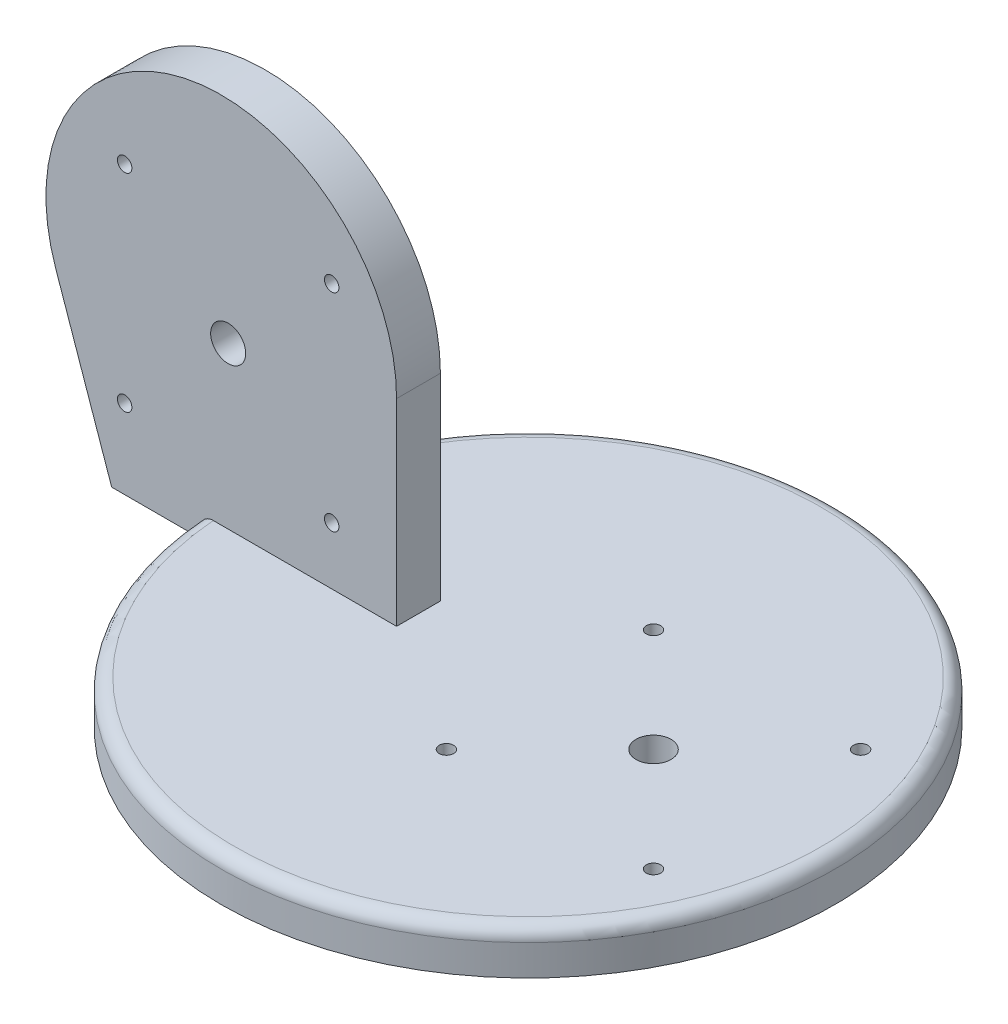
ISO-10303-21;
HEADER;
FILE_DESCRIPTION(('STEP AP214'),'2;1');
FILE_NAME('part.step','',(''),(''),'','','');
FILE_SCHEMA(('AUTOMOTIVE_DESIGN { 1 0 10303 214 1 1 1 1 }'));
ENDSEC;
DATA;
#1=APPLICATION_CONTEXT('core data for automotive mechanical design processes');
#2=APPLICATION_PROTOCOL_DEFINITION('international standard','automotive_design',2000,#1);
#3=PRODUCT_CONTEXT('',#1,'mechanical');
#4=PRODUCT('Part','Part','',(#3));
#5=PRODUCT_RELATED_PRODUCT_CATEGORY('part','',(#4));
#6=PRODUCT_DEFINITION_FORMATION('','',#4);
#7=PRODUCT_DEFINITION_CONTEXT('part definition',#1,'design');
#8=PRODUCT_DEFINITION('design','',#6,#7);
#9=PRODUCT_DEFINITION_SHAPE('','',#8);
#10=(LENGTH_UNIT() NAMED_UNIT(*) SI_UNIT(.MILLI.,.METRE.));
#11=(NAMED_UNIT(*) PLANE_ANGLE_UNIT() SI_UNIT($,.RADIAN.));
#12=(NAMED_UNIT(*) SI_UNIT($,.STERADIAN.) SOLID_ANGLE_UNIT());
#13=UNCERTAINTY_MEASURE_WITH_UNIT(LENGTH_MEASURE(1.E-05),#10,'distance_accuracy_value','');
#14=(GEOMETRIC_REPRESENTATION_CONTEXT(3) GLOBAL_UNCERTAINTY_ASSIGNED_CONTEXT((#13)) GLOBAL_UNIT_ASSIGNED_CONTEXT((#10,
#11,#12)) REPRESENTATION_CONTEXT('',''));
#15=CARTESIAN_POINT('',(0.,0.,0.));
#16=DIRECTION('',(0.,0.,1.));
#17=DIRECTION('',(1.,0.,0.));
#18=AXIS2_PLACEMENT_3D('',#15,#16,#17);
#19=CARTESIAN_POINT('',(0.,10.,0.));
#20=DIRECTION('',(0.,-1.,0.));
#21=DIRECTION('',(0.,0.,-1.));
#22=AXIS2_PLACEMENT_3D('',#19,#20,#21);
#23=CYLINDRICAL_SURFACE('',#22,70.);
#24=CARTESIAN_POINT('',(0.,0.,0.));
#25=DIRECTION('',(0.,1.,0.));
#26=DIRECTION('',(0.,0.,1.));
#27=AXIS2_PLACEMENT_3D('',#24,#25,#26);
#28=CIRCLE('',#27,70.);
#29=CARTESIAN_POINT('',(0.,0.,70.));
#30=VERTEX_POINT('',#29);
#31=EDGE_CURVE('E222',#30,#30,#28,.T.);
#32=ORIENTED_EDGE('',*,*,#31,.T.);
#33=EDGE_LOOP('',(#32));
#34=FACE_BOUND('',#33,.T.);
#35=DIRECTION('',(0.,-1.,0.));
#36=VECTOR('',#35,1.);
#37=CARTESIAN_POINT('',(-69.8212002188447,10.,-5.));
#38=LINE('',#37,#36);
#39=CARTESIAN_POINT('',(-69.8212002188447,4.99999999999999,-5.));
#40=VERTEX_POINT('',#39);
#41=CARTESIAN_POINT('',(-69.8212002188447,7.,-5.));
#42=VERTEX_POINT('',#41);
#43=EDGE_CURVE('E215',#40,#42,#38,.F.);
#44=ORIENTED_EDGE('',*,*,#43,.T.);
#45=CARTESIAN_POINT('',(0.,7.,0.));
#46=DIRECTION('',(0.,1.,0.));
#47=DIRECTION('',(0.,0.,1.));
#48=AXIS2_PLACEMENT_3D('',#45,#46,#47);
#49=CIRCLE('',#48,70.);
#50=CARTESIAN_POINT('',(-69.8212002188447,7.,5.));
#51=VERTEX_POINT('',#50);
#52=EDGE_CURVE('E62',#42,#51,#49,.F.);
#53=ORIENTED_EDGE('',*,*,#52,.T.);
#54=DIRECTION('',(0.,-1.,0.));
#55=VECTOR('',#54,1.);
#56=CARTESIAN_POINT('',(-69.8212002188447,10.,5.));
#57=LINE('',#56,#55);
#58=CARTESIAN_POINT('',(-69.8212002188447,4.99999999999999,5.));
#59=VERTEX_POINT('',#58);
#60=EDGE_CURVE('E217',#59,#51,#57,.F.);
#61=ORIENTED_EDGE('',*,*,#60,.F.);
#62=CARTESIAN_POINT('',(0.,5.,0.));
#63=DIRECTION('',(0.,1.,0.));
#64=DIRECTION('',(-1.,0.,0.));
#65=AXIS2_PLACEMENT_3D('',#62,#63,#64);
#66=CIRCLE('',#65,70.);
#67=EDGE_CURVE('E235',#40,#59,#66,.T.);
#68=ORIENTED_EDGE('',*,*,#67,.F.);
#69=EDGE_LOOP('',(#44,#53,#61,#68));
#70=FACE_BOUND('',#69,.T.);
#71=ADVANCED_FACE('F36',(#34,#70),#23,.T.);
#72=CARTESIAN_POINT('',(0.,10.,0.));
#73=DIRECTION('',(0.,1.,0.));
#74=DIRECTION('',(0.,0.,1.));
#75=AXIS2_PLACEMENT_3D('',#72,#73,#74);
#76=PLANE('',#75);
#77=CARTESIAN_POINT('',(28.624,10.,0.00199999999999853));
#78=DIRECTION('',(0.,1.,0.));
#79=DIRECTION('',(0.,0.,1.));
#80=AXIS2_PLACEMENT_3D('',#77,#78,#79);
#81=CIRCLE('',#80,3.99999999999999);
#82=CARTESIAN_POINT('',(28.624,10.,4.00199999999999));
#83=VERTEX_POINT('',#82);
#84=EDGE_CURVE('E609',#83,#83,#81,.T.);
#85=ORIENTED_EDGE('',*,*,#84,.F.);
#86=EDGE_LOOP('',(#85));
#87=FACE_BOUND('',#86,.T.);
#88=CARTESIAN_POINT('',(5.,10.,-23.622));
#89=DIRECTION('',(0.,1.,0.));
#90=DIRECTION('',(0.,0.,1.));
#91=AXIS2_PLACEMENT_3D('',#88,#89,#90);
#92=CIRCLE('',#91,1.64999999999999);
#93=CARTESIAN_POINT('',(5.,10.,-21.972));
#94=VERTEX_POINT('',#93);
#95=EDGE_CURVE('E162',#94,#94,#92,.T.);
#96=ORIENTED_EDGE('',*,*,#95,.F.);
#97=EDGE_LOOP('',(#96));
#98=FACE_BOUND('',#97,.T.);
#99=CARTESIAN_POINT('',(52.244,10.,-23.622));
#100=DIRECTION('',(0.,1.,0.));
#101=DIRECTION('',(0.,0.,1.));
#102=AXIS2_PLACEMENT_3D('',#99,#100,#101);
#103=CIRCLE('',#102,1.64999999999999);
#104=CARTESIAN_POINT('',(52.244,10.,-21.972));
#105=VERTEX_POINT('',#104);
#106=EDGE_CURVE('E168',#105,#105,#103,.T.);
#107=ORIENTED_EDGE('',*,*,#106,.F.);
#108=EDGE_LOOP('',(#107));
#109=FACE_BOUND('',#108,.T.);
#110=CARTESIAN_POINT('',(52.244,10.,23.622));
#111=DIRECTION('',(0.,1.,0.));
#112=DIRECTION('',(0.,0.,1.));
#113=AXIS2_PLACEMENT_3D('',#110,#111,#112);
#114=CIRCLE('',#113,1.64999999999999);
#115=CARTESIAN_POINT('',(52.244,10.,25.272));
#116=VERTEX_POINT('',#115);
#117=EDGE_CURVE('E174',#116,#116,#114,.T.);
#118=ORIENTED_EDGE('',*,*,#117,.F.);
#119=EDGE_LOOP('',(#118));
#120=FACE_BOUND('',#119,.T.);
#121=CARTESIAN_POINT('',(5.,10.,23.622));
#122=DIRECTION('',(0.,1.,0.));
#123=DIRECTION('',(0.,0.,1.));
#124=AXIS2_PLACEMENT_3D('',#121,#122,#123);
#125=CIRCLE('',#124,1.64999999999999);
#126=CARTESIAN_POINT('',(5.,10.,25.272));
#127=VERTEX_POINT('',#126);
#128=EDGE_CURVE('E180',#127,#127,#125,.T.);
#129=ORIENTED_EDGE('',*,*,#128,.F.);
#130=EDGE_LOOP('',(#129));
#131=FACE_BOUND('',#130,.T.);
#132=DIRECTION('',(-1.,0.,0.));
#133=VECTOR('',#132,1.);
#134=CARTESIAN_POINT('',(0.,10.,5.));
#135=LINE('',#134,#133);
#136=CARTESIAN_POINT('',(-25.,10.,5.));
#137=VERTEX_POINT('',#136);
#138=CARTESIAN_POINT('',(-66.8131723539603,10.,5.));
#139=VERTEX_POINT('',#138);
#140=EDGE_CURVE('E232',#137,#139,#135,.T.);
#141=ORIENTED_EDGE('',*,*,#140,.T.);
#142=CARTESIAN_POINT('',(0.,10.,0.));
#143=DIRECTION('',(0.,1.,0.));
#144=DIRECTION('',(0.,0.,1.));
#145=AXIS2_PLACEMENT_3D('',#142,#143,#144);
#146=CIRCLE('',#145,67.);
#147=CARTESIAN_POINT('',(-66.8131723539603,10.,-5.));
#148=VERTEX_POINT('',#147);
#149=EDGE_CURVE('E238',#139,#148,#146,.T.);
#150=ORIENTED_EDGE('',*,*,#149,.T.);
#151=DIRECTION('',(-1.,0.,0.));
#152=VECTOR('',#151,1.);
#153=CARTESIAN_POINT('',(0.,10.,-5.));
#154=LINE('',#153,#152);
#155=CARTESIAN_POINT('',(-25.,10.,-5.));
#156=VERTEX_POINT('',#155);
#157=EDGE_CURVE('E226',#156,#148,#154,.T.);
#158=ORIENTED_EDGE('',*,*,#157,.F.);
#159=DIRECTION('',(0.,0.,1.));
#160=VECTOR('',#159,1.);
#161=CARTESIAN_POINT('',(-25.,10.,0.));
#162=LINE('',#161,#160);
#163=EDGE_CURVE('E230',#156,#137,#162,.T.);
#164=ORIENTED_EDGE('',*,*,#163,.T.);
#165=EDGE_LOOP('',(#141,#150,#158,#164));
#166=FACE_BOUND('',#165,.T.);
#167=ADVANCED_FACE('F279',(#87,#98,#109,#120,#131,#166),#76,.T.);
#168=CARTESIAN_POINT('',(0.,0.,0.));
#169=DIRECTION('',(0.,1.,0.));
#170=DIRECTION('',(0.,0.,1.));
#171=AXIS2_PLACEMENT_3D('',#168,#169,#170);
#172=PLANE('',#171);
#173=CARTESIAN_POINT('',(0.,0.,0.));
#174=DIRECTION('',(0.,-1.,0.));
#175=DIRECTION('',(0.,0.,-1.));
#176=AXIS2_PLACEMENT_3D('',#173,#174,#175);
#177=CIRCLE('',#176,65.);
#178=CARTESIAN_POINT('',(0.,0.,-65.));
#179=VERTEX_POINT('',#178);
#180=EDGE_CURVE('E223',#179,#179,#177,.T.);
#181=ORIENTED_EDGE('',*,*,#180,.F.);
#182=EDGE_LOOP('',(#181));
#183=FACE_BOUND('',#182,.T.);
#184=ORIENTED_EDGE('',*,*,#31,.F.);
#185=EDGE_LOOP('',(#184));
#186=FACE_BOUND('',#185,.T.);
#187=ADVANCED_FACE('F277',(#183,#186),#172,.F.);
#188=CARTESIAN_POINT('',(0.,-3.,0.));
#189=DIRECTION('',(0.,1.,0.));
#190=DIRECTION('',(0.,0.,1.));
#191=AXIS2_PLACEMENT_3D('',#188,#189,#190);
#192=CYLINDRICAL_SURFACE('',#191,65.);
#193=CARTESIAN_POINT('',(0.,-3.,0.));
#194=DIRECTION('',(0.,-1.,0.));
#195=DIRECTION('',(0.,0.,-1.));
#196=AXIS2_PLACEMENT_3D('',#193,#194,#195);
#197=CIRCLE('',#196,65.);
#198=CARTESIAN_POINT('',(0.,-3.,-65.));
#199=VERTEX_POINT('',#198);
#200=EDGE_CURVE('E219',#199,#199,#197,.T.);
#201=ORIENTED_EDGE('',*,*,#200,.F.);
#202=EDGE_LOOP('',(#201));
#203=FACE_BOUND('',#202,.T.);
#204=ORIENTED_EDGE('',*,*,#180,.T.);
#205=EDGE_LOOP('',(#204));
#206=FACE_BOUND('',#205,.T.);
#207=ADVANCED_FACE('F273',(#203,#206),#192,.T.);
#208=CARTESIAN_POINT('',(0.,-3.,0.));
#209=DIRECTION('',(0.,-1.,0.));
#210=DIRECTION('',(0.,0.,-1.));
#211=AXIS2_PLACEMENT_3D('',#208,#209,#210);
#212=PLANE('',#211);
#213=CARTESIAN_POINT('',(28.624,-3.,0.00199999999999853));
#214=DIRECTION('',(0.,1.,0.));
#215=DIRECTION('',(0.,0.,1.));
#216=AXIS2_PLACEMENT_3D('',#213,#214,#215);
#217=CIRCLE('',#216,4.);
#218=CARTESIAN_POINT('',(28.624,-3.,4.002));
#219=VERTEX_POINT('',#218);
#220=EDGE_CURVE('E138',#219,#219,#217,.T.);
#221=ORIENTED_EDGE('',*,*,#220,.T.);
#222=EDGE_LOOP('',(#221));
#223=FACE_BOUND('',#222,.T.);
#224=ORIENTED_EDGE('',*,*,#200,.T.);
#225=EDGE_LOOP('',(#224));
#226=FACE_BOUND('',#225,.T.);
#227=ADVANCED_FACE('F270',(#223,#226),#212,.T.);
#228=CARTESIAN_POINT('',(-65.,55.,5.));
#229=DIRECTION('',(0.,0.,-1.));
#230=DIRECTION('',(-1.,0.,0.));
#231=AXIS2_PLACEMENT_3D('',#228,#229,#230);
#232=PLANE('',#231);
#233=CARTESIAN_POINT('',(-87.0402855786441,70.3170248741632,5.));
#234=DIRECTION('',(0.,0.,1.));
#235=DIRECTION('',(1.,0.,0.));
#236=AXIS2_PLACEMENT_3D('',#233,#234,#235);
#237=CIRCLE('',#236,1.64999999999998);
#238=CARTESIAN_POINT('',(-85.3902855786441,70.3170248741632,5.));
#239=VERTEX_POINT('',#238);
#240=EDGE_CURVE('E132',#239,#239,#237,.T.);
#241=ORIENTED_EDGE('',*,*,#240,.F.);
#242=EDGE_LOOP('',(#241));
#243=FACE_BOUND('',#242,.T.);
#244=CARTESIAN_POINT('',(-39.8002855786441,70.3170248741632,5.));
#245=DIRECTION('',(0.,0.,1.));
#246=DIRECTION('',(1.,0.,0.));
#247=AXIS2_PLACEMENT_3D('',#244,#245,#246);
#248=CIRCLE('',#247,1.64999999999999);
#249=CARTESIAN_POINT('',(-38.1502855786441,70.3170248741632,5.));
#250=VERTEX_POINT('',#249);
#251=EDGE_CURVE('E131',#250,#250,#248,.T.);
#252=ORIENTED_EDGE('',*,*,#251,.F.);
#253=EDGE_LOOP('',(#252));
#254=FACE_BOUND('',#253,.T.);
#255=CARTESIAN_POINT('',(-39.8002855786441,23.0770248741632,5.));
#256=DIRECTION('',(0.,0.,1.));
#257=DIRECTION('',(1.,0.,0.));
#258=AXIS2_PLACEMENT_3D('',#255,#256,#257);
#259=CIRCLE('',#258,1.64999999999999);
#260=CARTESIAN_POINT('',(-38.1502855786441,23.0770248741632,5.));
#261=VERTEX_POINT('',#260);
#262=EDGE_CURVE('E144',#261,#261,#259,.T.);
#263=ORIENTED_EDGE('',*,*,#262,.F.);
#264=EDGE_LOOP('',(#263));
#265=FACE_BOUND('',#264,.T.);
#266=CARTESIAN_POINT('',(-87.0402855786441,23.0770248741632,5.));
#267=DIRECTION('',(0.,0.,1.));
#268=DIRECTION('',(1.,0.,0.));
#269=AXIS2_PLACEMENT_3D('',#266,#267,#268);
#270=CIRCLE('',#269,1.64999999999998);
#271=CARTESIAN_POINT('',(-85.3902855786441,23.0770248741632,5.));
#272=VERTEX_POINT('',#271);
#273=EDGE_CURVE('E150',#272,#272,#270,.T.);
#274=ORIENTED_EDGE('',*,*,#273,.F.);
#275=EDGE_LOOP('',(#274));
#276=FACE_BOUND('',#275,.T.);
#277=CARTESIAN_POINT('',(-63.4202855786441,46.6970248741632,5.));
#278=DIRECTION('',(0.,0.,-1.));
#279=DIRECTION('',(-1.,0.,0.));
#280=AXIS2_PLACEMENT_3D('',#277,#278,#279);
#281=CIRCLE('',#280,3.99999999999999);
#282=CARTESIAN_POINT('',(-67.4202855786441,46.6970248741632,5.));
#283=VERTEX_POINT('',#282);
#284=EDGE_CURVE('E159',#283,#283,#281,.T.);
#285=ORIENTED_EDGE('',*,*,#284,.T.);
#286=EDGE_LOOP('',(#285));
#287=FACE_BOUND('',#286,.T.);
#288=DIRECTION('',(1.,0.,0.));
#289=VECTOR('',#288,1.);
#290=CARTESIAN_POINT('',(-25.,4.99999999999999,5.));
#291=LINE('',#290,#289);
#292=CARTESIAN_POINT('',(-90.,4.99999999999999,5.));
#293=VERTEX_POINT('',#292);
#294=EDGE_CURVE('E193',#293,#59,#291,.T.);
#295=ORIENTED_EDGE('',*,*,#294,.T.);
#296=ORIENTED_EDGE('',*,*,#60,.T.);
#297=CARTESIAN_POINT('',(-69.8212002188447,7.,5.));
#298=CARTESIAN_POINT('',(-69.8212084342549,7.08422120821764,5.));
#299=CARTESIAN_POINT('',(-69.8176445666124,7.1684385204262,5.));
#300=CARTESIAN_POINT('',(-69.8034362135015,7.33626942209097,5.));
#301=CARTESIAN_POINT('',(-69.7927921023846,7.41988304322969,5.));
#302=CARTESIAN_POINT('',(-69.7644984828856,7.58585112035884,5.));
#303=CARTESIAN_POINT('',(-69.7468547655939,7.6682065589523,5.));
#304=CARTESIAN_POINT('',(-69.7047069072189,7.8311180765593,5.));
#305=CARTESIAN_POINT('',(-69.6802028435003,7.91167417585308,5.));
#306=CARTESIAN_POINT('',(-69.5966030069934,8.149862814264,5.));
#307=CARTESIAN_POINT('',(-69.5274072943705,8.30408740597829,5.));
#308=CARTESIAN_POINT('',(-69.3641784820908,8.59863673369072,5.));
#309=CARTESIAN_POINT('',(-69.2701492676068,8.73896363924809,5.));
#310=CARTESIAN_POINT('',(-69.0597945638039,9.00205220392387,5.));
#311=CARTESIAN_POINT('',(-68.943444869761,9.12479453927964,5.));
#312=CARTESIAN_POINT('',(-68.6918108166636,9.34907894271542,5.));
#313=CARTESIAN_POINT('',(-68.556522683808,9.45061677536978,5.));
#314=CARTESIAN_POINT('',(-68.270509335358,9.62986808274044,5.));
#315=CARTESIAN_POINT('',(-68.1197445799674,9.70751840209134,5.));
#316=CARTESIAN_POINT('',(-67.8073684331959,9.83643772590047,5.));
#317=CARTESIAN_POINT('',(-67.645763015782,9.88772112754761,5.));
#318=CARTESIAN_POINT('',(-67.371540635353,9.95000516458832,5.));
#319=CARTESIAN_POINT('',(-67.2606182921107,9.96874219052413,5.));
#320=CARTESIAN_POINT('',(-67.037536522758,9.99373818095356,5.));
#321=CARTESIAN_POINT('',(-66.9253790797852,10.0000148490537,5.));
#322=CARTESIAN_POINT('',(-66.8131723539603,10.,5.));
#323=B_SPLINE_CURVE_WITH_KNOTS('',3,(#297,#298,#299,#300,#301,#302,#303,#304,#305,#306,#307,
#308,#309,#310,#311,#312,#313,#314,#315,#316,#317,#318,#319,#320,#321,#322),.UNSPECIFIED.,.F.,
.F.,(4,2,2,2,2,2,2,2,2,2,2,2,4),(0.,0.252581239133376,0.505149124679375,0.757508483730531,
1.00986499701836,1.51436249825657,2.01878111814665,2.52374986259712,3.02881937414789,
3.53521296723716,4.0413297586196,4.3781574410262,4.71450621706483),.UNSPECIFIED.);
#324=EDGE_CURVE('E11',#51,#139,#323,.T.);
#325=ORIENTED_EDGE('',*,*,#324,.T.);
#326=ORIENTED_EDGE('',*,*,#140,.F.);
#327=DIRECTION('',(0.,1.,0.));
#328=VECTOR('',#327,1.);
#329=CARTESIAN_POINT('',(-25.,55.,5.));
#330=LINE('',#329,#328);
#331=CARTESIAN_POINT('',(-25.,55.,5.));
#332=VERTEX_POINT('',#331);
#333=EDGE_CURVE('E196',#137,#332,#330,.T.);
#334=ORIENTED_EDGE('',*,*,#333,.T.);
#335=CARTESIAN_POINT('',(-65.,55.,5.));
#336=DIRECTION('',(0.,0.,1.));
#337=DIRECTION('',(-1.,0.,0.));
#338=AXIS2_PLACEMENT_3D('',#335,#336,#337);
#339=CIRCLE('',#338,40.);
#340=CARTESIAN_POINT('',(-102.792798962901,41.8963994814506,5.));
#341=VERTEX_POINT('',#340);
#342=EDGE_CURVE('E187',#332,#341,#339,.T.);
#343=ORIENTED_EDGE('',*,*,#342,.T.);
#344=DIRECTION('',(0.327590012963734,-0.944819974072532,0.));
#345=VECTOR('',#344,1.);
#346=CARTESIAN_POINT('',(-90.,4.99999999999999,5.));
#347=LINE('',#346,#345);
#348=EDGE_CURVE('E190',#341,#293,#347,.T.);
#349=ORIENTED_EDGE('',*,*,#348,.T.);
#350=EDGE_LOOP('',(#295,#296,#325,#326,#334,#343,#349));
#351=FACE_BOUND('',#350,.T.);
#352=ADVANCED_FACE('F250',(#243,#254,#265,#276,#287,#351),#232,.F.);
#353=CARTESIAN_POINT('',(-65.,55.,-5.));
#354=DIRECTION('',(0.,0.,-1.));
#355=DIRECTION('',(-1.,0.,0.));
#356=AXIS2_PLACEMENT_3D('',#353,#354,#355);
#357=PLANE('',#356);
#358=CARTESIAN_POINT('',(-63.4202855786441,46.6970248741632,-5.));
#359=DIRECTION('',(0.,0.,-1.));
#360=DIRECTION('',(-1.,0.,0.));
#361=AXIS2_PLACEMENT_3D('',#358,#359,#360);
#362=CIRCLE('',#361,3.99999999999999);
#363=CARTESIAN_POINT('',(-67.4202855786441,46.6970248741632,-5.));
#364=VERTEX_POINT('',#363);
#365=EDGE_CURVE('E156',#364,#364,#362,.T.);
#366=ORIENTED_EDGE('',*,*,#365,.F.);
#367=EDGE_LOOP('',(#366));
#368=FACE_BOUND('',#367,.T.);
#369=ORIENTED_EDGE('',*,*,#43,.F.);
#370=DIRECTION('',(1.,0.,0.));
#371=VECTOR('',#370,1.);
#372=CARTESIAN_POINT('',(-25.,4.99999999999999,-5.));
#373=LINE('',#372,#371);
#374=CARTESIAN_POINT('',(-90.,4.99999999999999,-5.));
#375=VERTEX_POINT('',#374);
#376=EDGE_CURVE('E203',#375,#40,#373,.T.);
#377=ORIENTED_EDGE('',*,*,#376,.F.);
#378=DIRECTION('',(0.327590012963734,-0.944819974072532,0.));
#379=VECTOR('',#378,1.);
#380=CARTESIAN_POINT('',(-90.,4.99999999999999,-5.));
#381=LINE('',#380,#379);
#382=CARTESIAN_POINT('',(-102.792798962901,41.8963994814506,-5.));
#383=VERTEX_POINT('',#382);
#384=EDGE_CURVE('E201',#383,#375,#381,.T.);
#385=ORIENTED_EDGE('',*,*,#384,.F.);
#386=CARTESIAN_POINT('',(-65.,55.,-5.));
#387=DIRECTION('',(0.,0.,1.));
#388=DIRECTION('',(-1.,0.,0.));
#389=AXIS2_PLACEMENT_3D('',#386,#387,#388);
#390=CIRCLE('',#389,40.);
#391=CARTESIAN_POINT('',(-25.,55.,-5.));
#392=VERTEX_POINT('',#391);
#393=EDGE_CURVE('E186',#392,#383,#390,.T.);
#394=ORIENTED_EDGE('',*,*,#393,.F.);
#395=DIRECTION('',(0.,1.,0.));
#396=VECTOR('',#395,1.);
#397=CARTESIAN_POINT('',(-25.,55.,-5.));
#398=LINE('',#397,#396);
#399=EDGE_CURVE('E191',#156,#392,#398,.T.);
#400=ORIENTED_EDGE('',*,*,#399,.F.);
#401=ORIENTED_EDGE('',*,*,#157,.T.);
#402=CARTESIAN_POINT('',(-66.8131723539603,10.,-5.));
#403=CARTESIAN_POINT('',(-66.8979472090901,10.0000079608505,-5.));
#404=CARTESIAN_POINT('',(-66.9827183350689,9.99642664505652,-5.));
#405=CARTESIAN_POINT('',(-67.1516555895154,9.98214661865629,-5.));
#406=CARTESIAN_POINT('',(-67.235821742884,9.97144820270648,-5.));
#407=CARTESIAN_POINT('',(-67.4029023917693,9.94300469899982,-5.));
#408=CARTESIAN_POINT('',(-67.4858176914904,9.92526435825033,-5.));
#409=CARTESIAN_POINT('',(-67.6498390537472,9.88287845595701,-5.));
#410=CARTESIAN_POINT('',(-67.7309451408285,9.85823298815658,-5.));
#411=CARTESIAN_POINT('',(-67.9707715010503,9.77413166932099,-5.));
#412=CARTESIAN_POINT('',(-68.1260623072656,9.70450022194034,-5.));
#413=CARTESIAN_POINT('',(-68.4226111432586,9.54016784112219,-5.));
#414=CARTESIAN_POINT('',(-68.5638719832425,9.44547194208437,-5.));
#415=CARTESIAN_POINT('',(-68.8282863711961,9.23378792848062,-5.));
#416=CARTESIAN_POINT('',(-68.9514639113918,9.11682983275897,-5.));
#417=CARTESIAN_POINT('',(-69.1763930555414,8.86382096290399,-5.));
#418=CARTESIAN_POINT('',(-69.2781405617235,8.72776654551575,-5.));
#419=CARTESIAN_POINT('',(-69.4570370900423,8.44080697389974,-5.));
#420=CARTESIAN_POINT('',(-69.5342432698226,8.28993741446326,-5.));
#421=CARTESIAN_POINT('',(-69.6621227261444,7.97738913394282,-5.));
#422=CARTESIAN_POINT('',(-69.712812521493,7.81571721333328,-5.));
#423=CARTESIAN_POINT('',(-69.7733449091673,7.54417781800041,-5.));
#424=CARTESIAN_POINT('',(-69.7912798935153,7.43604579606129,-5.));
#425=CARTESIAN_POINT('',(-69.8152057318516,7.21862459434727,-5.));
#426=CARTESIAN_POINT('',(-69.8212135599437,7.10933728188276,-5.));
#427=CARTESIAN_POINT('',(-69.8212002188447,7.,-5.));
#428=B_SPLINE_CURVE_WITH_KNOTS('',3,(#402,#403,#404,#405,#406,#407,#408,#409,#410,#411,#412,
#413,#414,#415,#416,#417,#418,#419,#420,#421,#422,#423,#424,#425,#426,#427),.UNSPECIFIED.,.F.,
.F.,(4,2,2,2,2,2,2,2,2,2,2,2,4),(0.,0.254242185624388,0.508473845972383,0.762534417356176,
1.01659153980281,1.52451815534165,2.03234282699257,2.5394875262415,3.04672911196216,
3.55278050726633,4.0585162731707,4.38673328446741,4.71448285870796),.UNSPECIFIED.);
#429=EDGE_CURVE('E49',#148,#42,#428,.T.);
#430=ORIENTED_EDGE('',*,*,#429,.T.);
#431=EDGE_LOOP('',(#369,#377,#385,#394,#400,#401,#430));
#432=FACE_BOUND('',#431,.T.);
#433=ADVANCED_FACE('F245',(#368,#432),#357,.T.);
#434=CARTESIAN_POINT('',(-65.,55.,5.));
#435=DIRECTION('',(0.,0.,-1.));
#436=DIRECTION('',(-1.,0.,0.));
#437=AXIS2_PLACEMENT_3D('',#434,#435,#436);
#438=CYLINDRICAL_SURFACE('',#437,40.);
#439=ORIENTED_EDGE('',*,*,#393,.T.);
#440=DIRECTION('',(0.,0.,-1.));
#441=VECTOR('',#440,1.);
#442=CARTESIAN_POINT('',(-102.792798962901,41.8963994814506,5.));
#443=LINE('',#442,#441);
#444=EDGE_CURVE('E212',#341,#383,#443,.T.);
#445=ORIENTED_EDGE('',*,*,#444,.F.);
#446=ORIENTED_EDGE('',*,*,#342,.F.);
#447=DIRECTION('',(0.,0.,-1.));
#448=VECTOR('',#447,1.);
#449=CARTESIAN_POINT('',(-25.,55.,5.));
#450=LINE('',#449,#448);
#451=EDGE_CURVE('E198',#332,#392,#450,.T.);
#452=ORIENTED_EDGE('',*,*,#451,.T.);
#453=EDGE_LOOP('',(#439,#445,#446,#452));
#454=FACE_BOUND('',#453,.T.);
#455=ADVANCED_FACE('F249',(#454),#438,.T.);
#456=CARTESIAN_POINT('',(-90.,4.99999999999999,5.));
#457=DIRECTION('',(0.944819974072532,0.327590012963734,0.));
#458=DIRECTION('',(-0.327590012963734,0.944819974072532,0.));
#459=AXIS2_PLACEMENT_3D('',#456,#457,#458);
#460=PLANE('',#459);
#461=ORIENTED_EDGE('',*,*,#384,.T.);
#462=DIRECTION('',(0.,0.,-1.));
#463=VECTOR('',#462,1.);
#464=CARTESIAN_POINT('',(-90.,4.99999999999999,5.));
#465=LINE('',#464,#463);
#466=EDGE_CURVE('E209',#293,#375,#465,.T.);
#467=ORIENTED_EDGE('',*,*,#466,.F.);
#468=ORIENTED_EDGE('',*,*,#348,.F.);
#469=ORIENTED_EDGE('',*,*,#444,.T.);
#470=EDGE_LOOP('',(#461,#467,#468,#469));
#471=FACE_BOUND('',#470,.T.);
#472=ADVANCED_FACE('F262',(#471),#460,.F.);
#473=CARTESIAN_POINT('',(-25.,4.99999999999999,5.));
#474=DIRECTION('',(0.,1.,0.));
#475=DIRECTION('',(-1.,0.,0.));
#476=AXIS2_PLACEMENT_3D('',#473,#474,#475);
#477=PLANE('',#476);
#478=ORIENTED_EDGE('',*,*,#376,.T.);
#479=ORIENTED_EDGE('',*,*,#67,.T.);
#480=ORIENTED_EDGE('',*,*,#294,.F.);
#481=ORIENTED_EDGE('',*,*,#466,.T.);
#482=EDGE_LOOP('',(#478,#479,#480,#481));
#483=FACE_BOUND('',#482,.T.);
#484=ADVANCED_FACE('F258',(#483),#477,.F.);
#485=CARTESIAN_POINT('',(-25.,55.,5.));
#486=DIRECTION('',(-1.,0.,0.));
#487=DIRECTION('',(0.,-1.,0.));
#488=AXIS2_PLACEMENT_3D('',#485,#486,#487);
#489=PLANE('',#488);
#490=ORIENTED_EDGE('',*,*,#163,.F.);
#491=ORIENTED_EDGE('',*,*,#399,.T.);
#492=ORIENTED_EDGE('',*,*,#451,.F.);
#493=ORIENTED_EDGE('',*,*,#333,.F.);
#494=EDGE_LOOP('',(#490,#491,#492,#493));
#495=FACE_BOUND('',#494,.T.);
#496=ADVANCED_FACE('F254',(#495),#489,.F.);
#497=CARTESIAN_POINT('',(5.,4.,23.622));
#498=DIRECTION('',(0.,1.,0.));
#499=DIRECTION('',(0.,0.,1.));
#500=AXIS2_PLACEMENT_3D('',#497,#498,#499);
#501=CONICAL_SURFACE('',#500,1.65,1.02974425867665);
#502=CARTESIAN_POINT('',(5.,3.00857997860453,23.622));
#503=VERTEX_POINT('',#502);
#504=VERTEX_LOOP('',#503);
#505=FACE_BOUND('',#504,.T.);
#506=CARTESIAN_POINT('',(5.,4.,23.622));
#507=DIRECTION('',(0.,1.,0.));
#508=DIRECTION('',(0.,0.,1.));
#509=AXIS2_PLACEMENT_3D('',#506,#507,#508);
#510=CIRCLE('',#509,1.65);
#511=CARTESIAN_POINT('',(5.,4.,25.272));
#512=VERTEX_POINT('',#511);
#513=EDGE_CURVE('E183',#512,#512,#510,.T.);
#514=ORIENTED_EDGE('',*,*,#513,.T.);
#515=EDGE_LOOP('',(#514));
#516=FACE_BOUND('',#515,.T.);
#517=ADVANCED_FACE('F257',(#505,#516),#501,.F.);
#518=CARTESIAN_POINT('',(5.,10.,23.622));
#519=DIRECTION('',(0.,1.,0.));
#520=DIRECTION('',(0.,0.,1.));
#521=AXIS2_PLACEMENT_3D('',#518,#519,#520);
#522=CYLINDRICAL_SURFACE('',#521,1.64999999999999);
#523=ORIENTED_EDGE('',*,*,#513,.F.);
#524=EDGE_LOOP('',(#523));
#525=FACE_BOUND('',#524,.T.);
#526=ORIENTED_EDGE('',*,*,#128,.T.);
#527=EDGE_LOOP('',(#526));
#528=FACE_BOUND('',#527,.T.);
#529=ADVANCED_FACE('F356',(#525,#528),#522,.F.);
#530=CARTESIAN_POINT('',(52.244,4.,23.622));
#531=DIRECTION('',(0.,1.,0.));
#532=DIRECTION('',(0.,0.,1.));
#533=AXIS2_PLACEMENT_3D('',#530,#531,#532);
#534=CONICAL_SURFACE('',#533,1.65,1.02974425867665);
#535=CARTESIAN_POINT('',(52.244,3.00857997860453,23.622));
#536=VERTEX_POINT('',#535);
#537=VERTEX_LOOP('',#536);
#538=FACE_BOUND('',#537,.T.);
#539=CARTESIAN_POINT('',(52.244,4.,23.622));
#540=DIRECTION('',(0.,1.,0.));
#541=DIRECTION('',(0.,0.,1.));
#542=AXIS2_PLACEMENT_3D('',#539,#540,#541);
#543=CIRCLE('',#542,1.65);
#544=CARTESIAN_POINT('',(52.244,4.,25.272));
#545=VERTEX_POINT('',#544);
#546=EDGE_CURVE('E177',#545,#545,#543,.T.);
#547=ORIENTED_EDGE('',*,*,#546,.T.);
#548=EDGE_LOOP('',(#547));
#549=FACE_BOUND('',#548,.T.);
#550=ADVANCED_FACE('F352',(#538,#549),#534,.F.);
#551=CARTESIAN_POINT('',(52.244,10.,23.622));
#552=DIRECTION('',(0.,1.,0.));
#553=DIRECTION('',(0.,0.,1.));
#554=AXIS2_PLACEMENT_3D('',#551,#552,#553);
#555=CYLINDRICAL_SURFACE('',#554,1.65);
#556=ORIENTED_EDGE('',*,*,#546,.F.);
#557=EDGE_LOOP('',(#556));
#558=FACE_BOUND('',#557,.T.);
#559=ORIENTED_EDGE('',*,*,#117,.T.);
#560=EDGE_LOOP('',(#559));
#561=FACE_BOUND('',#560,.T.);
#562=ADVANCED_FACE('F348',(#558,#561),#555,.F.);
#563=CARTESIAN_POINT('',(52.244,4.,-23.622));
#564=DIRECTION('',(0.,1.,0.));
#565=DIRECTION('',(0.,0.,1.));
#566=AXIS2_PLACEMENT_3D('',#563,#564,#565);
#567=CONICAL_SURFACE('',#566,1.65,1.02974425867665);
#568=CARTESIAN_POINT('',(52.244,3.00857997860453,-23.622));
#569=VERTEX_POINT('',#568);
#570=VERTEX_LOOP('',#569);
#571=FACE_BOUND('',#570,.T.);
#572=CARTESIAN_POINT('',(52.244,4.,-23.622));
#573=DIRECTION('',(0.,1.,0.));
#574=DIRECTION('',(0.,0.,1.));
#575=AXIS2_PLACEMENT_3D('',#572,#573,#574);
#576=CIRCLE('',#575,1.65);
#577=CARTESIAN_POINT('',(52.244,4.,-21.972));
#578=VERTEX_POINT('',#577);
#579=EDGE_CURVE('E171',#578,#578,#576,.T.);
#580=ORIENTED_EDGE('',*,*,#579,.T.);
#581=EDGE_LOOP('',(#580));
#582=FACE_BOUND('',#581,.T.);
#583=ADVANCED_FACE('F344',(#571,#582),#567,.F.);
#584=CARTESIAN_POINT('',(52.244,10.,-23.622));
#585=DIRECTION('',(0.,1.,0.));
#586=DIRECTION('',(0.,0.,1.));
#587=AXIS2_PLACEMENT_3D('',#584,#585,#586);
#588=CYLINDRICAL_SURFACE('',#587,1.65);
#589=ORIENTED_EDGE('',*,*,#579,.F.);
#590=EDGE_LOOP('',(#589));
#591=FACE_BOUND('',#590,.T.);
#592=ORIENTED_EDGE('',*,*,#106,.T.);
#593=EDGE_LOOP('',(#592));
#594=FACE_BOUND('',#593,.T.);
#595=ADVANCED_FACE('F340',(#591,#594),#588,.F.);
#596=CARTESIAN_POINT('',(5.,4.,-23.622));
#597=DIRECTION('',(0.,1.,0.));
#598=DIRECTION('',(0.,0.,1.));
#599=AXIS2_PLACEMENT_3D('',#596,#597,#598);
#600=CONICAL_SURFACE('',#599,1.65,1.02974425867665);
#601=CARTESIAN_POINT('',(5.,3.00857997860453,-23.622));
#602=VERTEX_POINT('',#601);
#603=VERTEX_LOOP('',#602);
#604=FACE_BOUND('',#603,.T.);
#605=CARTESIAN_POINT('',(5.,4.,-23.622));
#606=DIRECTION('',(0.,1.,0.));
#607=DIRECTION('',(0.,0.,1.));
#608=AXIS2_PLACEMENT_3D('',#605,#606,#607);
#609=CIRCLE('',#608,1.65);
#610=CARTESIAN_POINT('',(5.,4.,-21.972));
#611=VERTEX_POINT('',#610);
#612=EDGE_CURVE('E165',#611,#611,#609,.T.);
#613=ORIENTED_EDGE('',*,*,#612,.T.);
#614=EDGE_LOOP('',(#613));
#615=FACE_BOUND('',#614,.T.);
#616=ADVANCED_FACE('F333',(#604,#615),#600,.F.);
#617=CARTESIAN_POINT('',(5.,10.,-23.622));
#618=DIRECTION('',(0.,1.,0.));
#619=DIRECTION('',(0.,0.,1.));
#620=AXIS2_PLACEMENT_3D('',#617,#618,#619);
#621=CYLINDRICAL_SURFACE('',#620,1.64999999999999);
#622=ORIENTED_EDGE('',*,*,#612,.F.);
#623=EDGE_LOOP('',(#622));
#624=FACE_BOUND('',#623,.T.);
#625=ORIENTED_EDGE('',*,*,#95,.T.);
#626=EDGE_LOOP('',(#625));
#627=FACE_BOUND('',#626,.T.);
#628=ADVANCED_FACE('F323',(#624,#627),#621,.F.);
#629=CARTESIAN_POINT('',(-63.4202855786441,46.6970248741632,-5.));
#630=DIRECTION('',(0.,0.,-1.));
#631=DIRECTION('',(-1.,0.,0.));
#632=AXIS2_PLACEMENT_3D('',#629,#630,#631);
#633=CYLINDRICAL_SURFACE('',#632,3.99999999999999);
#634=ORIENTED_EDGE('',*,*,#365,.T.);
#635=EDGE_LOOP('',(#634));
#636=FACE_BOUND('',#635,.T.);
#637=ORIENTED_EDGE('',*,*,#284,.F.);
#638=EDGE_LOOP('',(#637));
#639=FACE_BOUND('',#638,.T.);
#640=ADVANCED_FACE('F320',(#636,#639),#633,.F.);
#641=CARTESIAN_POINT('',(-87.0402855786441,23.0770248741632,-0.999999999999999));
#642=DIRECTION('',(0.,0.,1.));
#643=DIRECTION('',(1.,0.,0.));
#644=AXIS2_PLACEMENT_3D('',#641,#642,#643);
#645=CONICAL_SURFACE('',#644,1.65,1.02974425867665);
#646=CARTESIAN_POINT('',(-87.0402855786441,23.0770248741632,-1.99142002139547));
#647=VERTEX_POINT('',#646);
#648=VERTEX_LOOP('',#647);
#649=FACE_BOUND('',#648,.T.);
#650=CARTESIAN_POINT('',(-87.0402855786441,23.0770248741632,-0.999999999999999));
#651=DIRECTION('',(0.,0.,1.));
#652=DIRECTION('',(1.,0.,0.));
#653=AXIS2_PLACEMENT_3D('',#650,#651,#652);
#654=CIRCLE('',#653,1.65);
#655=CARTESIAN_POINT('',(-85.3902855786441,23.0770248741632,-0.999999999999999));
#656=VERTEX_POINT('',#655);
#657=EDGE_CURVE('E153',#656,#656,#654,.T.);
#658=ORIENTED_EDGE('',*,*,#657,.T.);
#659=EDGE_LOOP('',(#658));
#660=FACE_BOUND('',#659,.T.);
#661=ADVANCED_FACE('F322',(#649,#660),#645,.F.);
#662=CARTESIAN_POINT('',(-87.0402855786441,23.0770248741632,5.));
#663=DIRECTION('',(0.,0.,1.));
#664=DIRECTION('',(1.,0.,0.));
#665=AXIS2_PLACEMENT_3D('',#662,#663,#664);
#666=CYLINDRICAL_SURFACE('',#665,1.64999999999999);
#667=ORIENTED_EDGE('',*,*,#657,.F.);
#668=EDGE_LOOP('',(#667));
#669=FACE_BOUND('',#668,.T.);
#670=ORIENTED_EDGE('',*,*,#273,.T.);
#671=EDGE_LOOP('',(#670));
#672=FACE_BOUND('',#671,.T.);
#673=ADVANCED_FACE('F330',(#669,#672),#666,.F.);
#674=CARTESIAN_POINT('',(-39.8002855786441,23.0770248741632,-0.999999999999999));
#675=DIRECTION('',(0.,0.,1.));
#676=DIRECTION('',(1.,0.,0.));
#677=AXIS2_PLACEMENT_3D('',#674,#675,#676);
#678=CONICAL_SURFACE('',#677,1.65,1.02974425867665);
#679=CARTESIAN_POINT('',(-39.8002855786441,23.0770248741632,-1.99142002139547));
#680=VERTEX_POINT('',#679);
#681=VERTEX_LOOP('',#680);
#682=FACE_BOUND('',#681,.T.);
#683=CARTESIAN_POINT('',(-39.8002855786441,23.0770248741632,-0.999999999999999));
#684=DIRECTION('',(0.,0.,1.));
#685=DIRECTION('',(1.,0.,0.));
#686=AXIS2_PLACEMENT_3D('',#683,#684,#685);
#687=CIRCLE('',#686,1.65);
#688=CARTESIAN_POINT('',(-38.1502855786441,23.0770248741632,-0.999999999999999));
#689=VERTEX_POINT('',#688);
#690=EDGE_CURVE('E147',#689,#689,#687,.T.);
#691=ORIENTED_EDGE('',*,*,#690,.T.);
#692=EDGE_LOOP('',(#691));
#693=FACE_BOUND('',#692,.T.);
#694=ADVANCED_FACE('F412',(#682,#693),#678,.F.);
#695=CARTESIAN_POINT('',(-39.8002855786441,23.0770248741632,5.));
#696=DIRECTION('',(0.,0.,1.));
#697=DIRECTION('',(1.,0.,0.));
#698=AXIS2_PLACEMENT_3D('',#695,#696,#697);
#699=CYLINDRICAL_SURFACE('',#698,1.65);
#700=ORIENTED_EDGE('',*,*,#690,.F.);
#701=EDGE_LOOP('',(#700));
#702=FACE_BOUND('',#701,.T.);
#703=ORIENTED_EDGE('',*,*,#262,.T.);
#704=EDGE_LOOP('',(#703));
#705=FACE_BOUND('',#704,.T.);
#706=ADVANCED_FACE('F419',(#702,#705),#699,.F.);
#707=CARTESIAN_POINT('',(-39.8002855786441,70.3170248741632,-0.999999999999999));
#708=DIRECTION('',(0.,0.,1.));
#709=DIRECTION('',(1.,0.,0.));
#710=AXIS2_PLACEMENT_3D('',#707,#708,#709);
#711=CONICAL_SURFACE('',#710,1.65,1.02974425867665);
#712=CARTESIAN_POINT('',(-39.8002855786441,70.3170248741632,-1.99142002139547));
#713=VERTEX_POINT('',#712);
#714=VERTEX_LOOP('',#713);
#715=FACE_BOUND('',#714,.T.);
#716=CARTESIAN_POINT('',(-39.8002855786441,70.3170248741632,-0.999999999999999));
#717=DIRECTION('',(0.,0.,1.));
#718=DIRECTION('',(1.,0.,0.));
#719=AXIS2_PLACEMENT_3D('',#716,#717,#718);
#720=CIRCLE('',#719,1.65);
#721=CARTESIAN_POINT('',(-38.1502855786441,70.3170248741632,-0.999999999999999));
#722=VERTEX_POINT('',#721);
#723=EDGE_CURVE('E135',#722,#722,#720,.T.);
#724=ORIENTED_EDGE('',*,*,#723,.T.);
#725=EDGE_LOOP('',(#724));
#726=FACE_BOUND('',#725,.T.);
#727=ADVANCED_FACE('F423',(#715,#726),#711,.F.);
#728=CARTESIAN_POINT('',(-39.8002855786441,70.3170248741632,5.));
#729=DIRECTION('',(0.,0.,1.));
#730=DIRECTION('',(1.,0.,0.));
#731=AXIS2_PLACEMENT_3D('',#728,#729,#730);
#732=CYLINDRICAL_SURFACE('',#731,1.65);
#733=ORIENTED_EDGE('',*,*,#723,.F.);
#734=EDGE_LOOP('',(#733));
#735=FACE_BOUND('',#734,.T.);
#736=ORIENTED_EDGE('',*,*,#251,.T.);
#737=EDGE_LOOP('',(#736));
#738=FACE_BOUND('',#737,.T.);
#739=ADVANCED_FACE('F125',(#735,#738),#732,.F.);
#740=CARTESIAN_POINT('',(-87.0402855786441,70.3170248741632,-0.999999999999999));
#741=DIRECTION('',(0.,0.,1.));
#742=DIRECTION('',(1.,0.,0.));
#743=AXIS2_PLACEMENT_3D('',#740,#741,#742);
#744=CONICAL_SURFACE('',#743,1.65,1.02974425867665);
#745=CARTESIAN_POINT('',(-87.0402855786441,70.3170248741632,-1.99142002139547));
#746=VERTEX_POINT('',#745);
#747=VERTEX_LOOP('',#746);
#748=FACE_BOUND('',#747,.T.);
#749=CARTESIAN_POINT('',(-87.0402855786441,70.3170248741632,-0.999999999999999));
#750=DIRECTION('',(0.,0.,1.));
#751=DIRECTION('',(1.,0.,0.));
#752=AXIS2_PLACEMENT_3D('',#749,#750,#751);
#753=CIRCLE('',#752,1.65);
#754=CARTESIAN_POINT('',(-85.3902855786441,70.3170248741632,-0.999999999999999));
#755=VERTEX_POINT('',#754);
#756=EDGE_CURVE('E129',#755,#755,#753,.T.);
#757=ORIENTED_EDGE('',*,*,#756,.T.);
#758=EDGE_LOOP('',(#757));
#759=FACE_BOUND('',#758,.T.);
#760=ADVANCED_FACE('F121',(#748,#759),#744,.F.);
#761=CARTESIAN_POINT('',(-87.0402855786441,70.3170248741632,5.));
#762=DIRECTION('',(0.,0.,1.));
#763=DIRECTION('',(1.,0.,0.));
#764=AXIS2_PLACEMENT_3D('',#761,#762,#763);
#765=CYLINDRICAL_SURFACE('',#764,1.64999999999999);
#766=ORIENTED_EDGE('',*,*,#756,.F.);
#767=EDGE_LOOP('',(#766));
#768=FACE_BOUND('',#767,.T.);
#769=ORIENTED_EDGE('',*,*,#240,.T.);
#770=EDGE_LOOP('',(#769));
#771=FACE_BOUND('',#770,.T.);
#772=ADVANCED_FACE('F124',(#768,#771),#765,.F.);
#773=CARTESIAN_POINT('',(28.624,10.,0.00199999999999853));
#774=DIRECTION('',(0.,1.,0.));
#775=DIRECTION('',(0.,0.,1.));
#776=AXIS2_PLACEMENT_3D('',#773,#774,#775);
#777=CYLINDRICAL_SURFACE('',#776,3.99999999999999);
#778=ORIENTED_EDGE('',*,*,#220,.F.);
#779=EDGE_LOOP('',(#778));
#780=FACE_BOUND('',#779,.T.);
#781=ORIENTED_EDGE('',*,*,#84,.T.);
#782=EDGE_LOOP('',(#781));
#783=FACE_BOUND('',#782,.T.);
#784=ADVANCED_FACE('F442',(#780,#783),#777,.F.);
#785=CARTESIAN_POINT('',(0.,7.,0.));
#786=DIRECTION('',(0.,1.,0.));
#787=DIRECTION('',(0.,0.,1.));
#788=AXIS2_PLACEMENT_3D('',#785,#786,#787);
#789=TOROIDAL_SURFACE('',#788,67.,3.);
#790=ORIENTED_EDGE('',*,*,#324,.F.);
#791=ORIENTED_EDGE('',*,*,#52,.F.);
#792=ORIENTED_EDGE('',*,*,#429,.F.);
#793=ORIENTED_EDGE('',*,*,#149,.F.);
#794=EDGE_LOOP('',(#790,#791,#792,#793));
#795=FACE_BOUND('',#794,.T.);
#796=ADVANCED_FACE('F38',(#795),#789,.T.);
#797=CLOSED_SHELL('',(#71,#167,#187,#207,#227,#352,#433,#455,#472,#484,#496,#517,#529,#550,#562,
#583,#595,#616,#628,#640,#661,#673,#694,#706,#727,#739,#760,#772,#784,#796));
#798=MANIFOLD_SOLID_BREP('B2',#797);
#799=ADVANCED_BREP_SHAPE_REPRESENTATION('',(#18,#798),#14);
#800=SHAPE_DEFINITION_REPRESENTATION(#9,#799);
ENDSEC;
END-ISO-10303-21;
